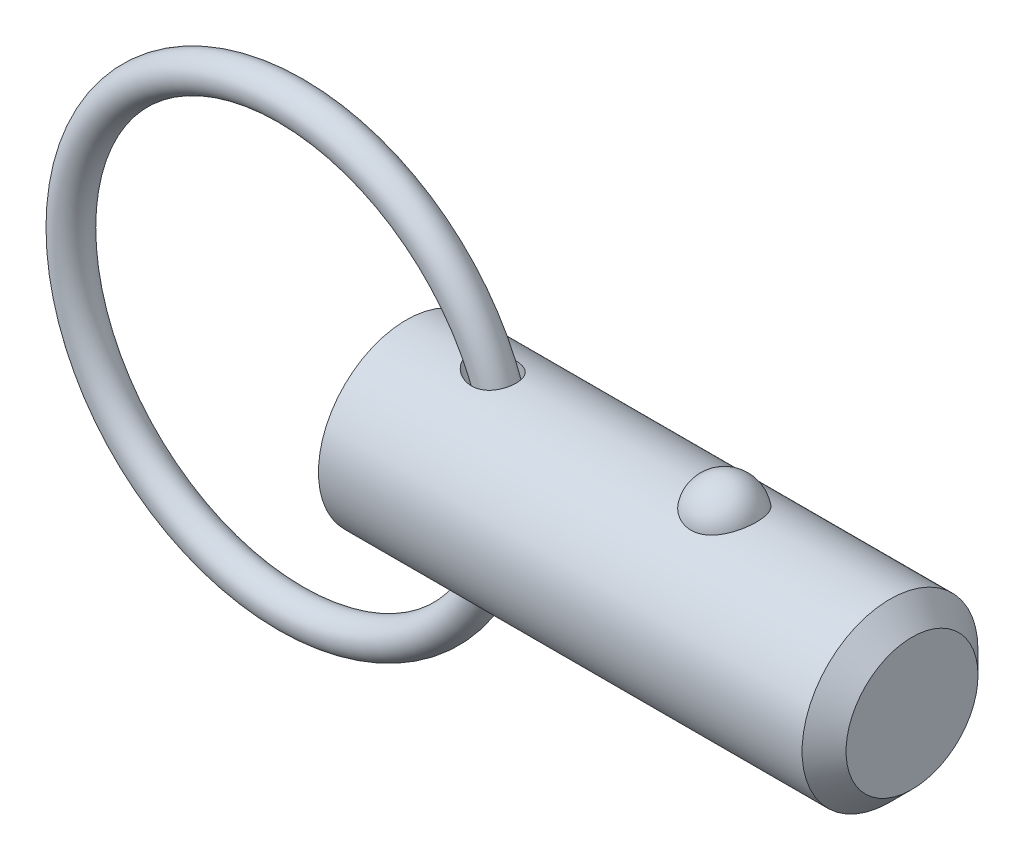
ISO-10303-21;
HEADER;
FILE_DESCRIPTION(('STEP AP214'),'2;1');
FILE_NAME('part.step','',(''),(''),'','','');
FILE_SCHEMA(('AUTOMOTIVE_DESIGN { 1 0 10303 214 1 1 1 1 }'));
ENDSEC;
DATA;
#1=APPLICATION_CONTEXT('core data for automotive mechanical design processes');
#2=APPLICATION_PROTOCOL_DEFINITION('international standard','automotive_design',2000,#1);
#3=PRODUCT_CONTEXT('',#1,'mechanical');
#4=PRODUCT('Part','Part','',(#3));
#5=PRODUCT_RELATED_PRODUCT_CATEGORY('part','',(#4));
#6=PRODUCT_DEFINITION_FORMATION('','',#4);
#7=PRODUCT_DEFINITION_CONTEXT('part definition',#1,'design');
#8=PRODUCT_DEFINITION('design','',#6,#7);
#9=PRODUCT_DEFINITION_SHAPE('','',#8);
#10=(LENGTH_UNIT() NAMED_UNIT(*) SI_UNIT(.MILLI.,.METRE.));
#11=(NAMED_UNIT(*) PLANE_ANGLE_UNIT() SI_UNIT($,.RADIAN.));
#12=(NAMED_UNIT(*) SI_UNIT($,.STERADIAN.) SOLID_ANGLE_UNIT());
#13=UNCERTAINTY_MEASURE_WITH_UNIT(LENGTH_MEASURE(1.E-05),#10,'distance_accuracy_value','');
#14=(GEOMETRIC_REPRESENTATION_CONTEXT(3) GLOBAL_UNCERTAINTY_ASSIGNED_CONTEXT((#13)) GLOBAL_UNIT_ASSIGNED_CONTEXT((#10,
#11,#12)) REPRESENTATION_CONTEXT('',''));
#15=CARTESIAN_POINT('',(0.,0.,0.));
#16=DIRECTION('',(0.,0.,1.));
#17=DIRECTION('',(1.,0.,0.));
#18=AXIS2_PLACEMENT_3D('',#15,#16,#17);
#19=CARTESIAN_POINT('',(-8.34703434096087,0.,0.));
#20=DIRECTION('',(0.,0.,1.));
#21=DIRECTION('',(1.,0.,0.));
#22=AXIS2_PLACEMENT_3D('',#19,#20,#21);
#23=TOROIDAL_SURFACE('',#22,15.875,1.27);
#24=CARTESIAN_POINT('',(8.79796565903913,0.,0.));
#25=VERTEX_POINT('',#24);
#26=VERTEX_LOOP('',#25);
#27=FACE_BOUND('',#26,.T.);
#28=ADVANCED_FACE('P0_F12',(#27),#23,.T.);
#29=CLOSED_SHELL('',(#28));
#30=MANIFOLD_SOLID_BREP('P0_B1',#29);
#31=CARTESIAN_POINT('',(0.,0.,0.));
#32=DIRECTION('',(1.,0.,0.));
#33=DIRECTION('',(0.,0.,-1.));
#34=AXIS2_PLACEMENT_3D('',#31,#32,#33);
#35=CYLINDRICAL_SURFACE('',#34,6.35);
#36=CARTESIAN_POINT('',(4.87230670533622,6.27273159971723,-0.987592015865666));
#37=CARTESIAN_POINT('',(4.94734735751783,6.26035058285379,-1.06623378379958));
#38=CARTESIAN_POINT('',(5.02968768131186,6.24755813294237,-1.13788608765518));
#39=CARTESIAN_POINT('',(5.2053426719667,6.22278258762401,-1.26640223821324));
#40=CARTESIAN_POINT('',(5.29867273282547,6.21080066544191,-1.32324497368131));
#41=CARTESIAN_POINT('',(5.49318962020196,6.18912414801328,-1.42117930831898));
#42=CARTESIAN_POINT('',(5.59435470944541,6.17942350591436,-1.46231273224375));
#43=CARTESIAN_POINT('',(5.80219659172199,6.16352555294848,-1.52793951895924));
#44=CARTESIAN_POINT('',(5.90887152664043,6.15732706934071,-1.55243845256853));
#45=CARTESIAN_POINT('',(6.12818220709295,6.14931784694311,-1.58387975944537));
#46=CARTESIAN_POINT('',(6.24090110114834,6.14763959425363,-1.59029227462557));
#47=CARTESIAN_POINT('',(6.46560233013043,6.14965588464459,-1.58248630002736));
#48=CARTESIAN_POINT('',(6.57758514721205,6.15334646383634,-1.56828303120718));
#49=CARTESIAN_POINT('',(6.78516594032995,6.1652116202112,-1.52091398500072));
#50=CARTESIAN_POINT('',(6.88126802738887,6.17288876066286,-1.48983713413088));
#51=CARTESIAN_POINT('',(7.06576629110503,6.19149190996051,-1.41052329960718));
#52=CARTESIAN_POINT('',(7.15416739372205,6.20241582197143,-1.36229738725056));
#53=CARTESIAN_POINT('',(7.31166929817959,6.2248616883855,-1.25548983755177));
#54=CARTESIAN_POINT('',(7.3818144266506,6.23621734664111,-1.19840625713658));
#55=CARTESIAN_POINT('',(7.51101296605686,6.259037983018,-1.07284763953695));
#56=CARTESIAN_POINT('',(7.57006844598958,6.2705029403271,-1.00437473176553));
#57=CARTESIAN_POINT('',(7.6737469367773,6.29184873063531,-0.860384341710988));
#58=CARTESIAN_POINT('',(7.71876694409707,6.30176816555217,-0.785157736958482));
#59=CARTESIAN_POINT('',(7.79574491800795,6.31935829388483,-0.628053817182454));
#60=CARTESIAN_POINT('',(7.82770308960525,6.32702902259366,-0.546176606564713));
#61=CARTESIAN_POINT('',(7.87788845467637,6.33930929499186,-0.377876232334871));
#62=CARTESIAN_POINT('',(7.89608106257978,6.34391112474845,-0.291442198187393));
#63=CARTESIAN_POINT('',(7.9182072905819,6.34953044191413,-0.116652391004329));
#64=CARTESIAN_POINT('',(7.92214044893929,6.35054781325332,-0.0282965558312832));
#65=CARTESIAN_POINT('',(7.91564686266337,6.34888556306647,0.148263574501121));
#66=CARTESIAN_POINT('',(7.90515337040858,6.34618875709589,0.236465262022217));
#67=CARTESIAN_POINT('',(7.8699153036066,6.33735741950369,0.409798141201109));
#68=CARTESIAN_POINT('',(7.84517062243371,6.33122286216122,0.494929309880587));
#69=CARTESIAN_POINT('',(7.7819985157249,6.31618517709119,0.659657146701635));
#70=CARTESIAN_POINT('',(7.74357645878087,6.30728313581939,0.739255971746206));
#71=CARTESIAN_POINT('',(7.65396632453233,6.28769050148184,0.890663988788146));
#72=CARTESIAN_POINT('',(7.60277911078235,6.27700002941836,0.962473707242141));
#73=CARTESIAN_POINT('',(7.48925881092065,6.2550822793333,1.09590260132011));
#74=CARTESIAN_POINT('',(7.42698604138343,6.24385813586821,1.15757361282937));
#75=CARTESIAN_POINT('',(7.29283556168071,6.2220655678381,1.26951234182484));
#76=CARTESIAN_POINT('',(7.22095880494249,6.21149707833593,1.31978118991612));
#77=CARTESIAN_POINT('',(7.06971853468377,6.19216002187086,1.40772509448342));
#78=CARTESIAN_POINT('',(6.99035873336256,6.18339056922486,1.44540635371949));
#79=CARTESIAN_POINT('',(6.82642723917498,6.16851603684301,1.50762653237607));
#80=CARTESIAN_POINT('',(6.7418548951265,6.16241129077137,1.53216380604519));
#81=CARTESIAN_POINT('',(6.56686412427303,6.15321474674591,1.56869994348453));
#82=CARTESIAN_POINT('',(6.47634467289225,6.15023369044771,1.58023897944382));
#83=CARTESIAN_POINT('',(6.29456956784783,6.14778331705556,1.58974172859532));
#84=CARTESIAN_POINT('',(6.20331368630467,6.1483151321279,1.58770106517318));
#85=CARTESIAN_POINT('',(6.01385969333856,6.15284811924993,1.5700487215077));
#86=CARTESIAN_POINT('',(5.91578322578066,6.15715979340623,1.55322212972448));
#87=CARTESIAN_POINT('',(5.72331909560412,6.16902415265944,1.5054032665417));
#88=CARTESIAN_POINT('',(5.6289344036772,6.17657939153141,1.4743998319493));
#89=CARTESIAN_POINT('',(5.4357260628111,6.19502494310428,1.39499475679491));
#90=CARTESIAN_POINT('',(5.33755891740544,6.20619097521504,1.34505268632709));
#91=CARTESIAN_POINT('',(5.15090047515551,6.23006191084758,1.22975103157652));
#92=CARTESIAN_POINT('',(5.06240741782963,6.24276653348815,1.16439425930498));
#93=CARTESIAN_POINT('',(4.91171642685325,6.26607433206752,1.03083814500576));
#94=CARTESIAN_POINT('',(4.84758224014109,6.27668356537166,0.964825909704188));
#95=CARTESIAN_POINT('',(4.73090054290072,6.29683133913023,0.823112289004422));
#96=CARTESIAN_POINT('',(4.67833688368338,6.30637136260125,0.747424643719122));
#97=CARTESIAN_POINT('',(4.59543145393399,6.32183254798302,0.601150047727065));
#98=CARTESIAN_POINT('',(4.56283099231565,6.32809321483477,0.531883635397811));
#99=CARTESIAN_POINT('',(4.50941370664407,6.33849198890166,0.388778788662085));
#100=CARTESIAN_POINT('',(4.48858876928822,6.34263155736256,0.314943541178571));
#101=CARTESIAN_POINT('',(4.46008864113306,6.3483236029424,0.164282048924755));
#102=CARTESIAN_POINT('',(4.45247558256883,6.34986385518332,0.08744340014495));
#103=CARTESIAN_POINT('',(4.45121096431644,6.35011863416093,-0.0663538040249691));
#104=CARTESIAN_POINT('',(4.45755802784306,6.34883343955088,-0.143312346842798));
#105=CARTESIAN_POINT('',(4.48267656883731,6.34380948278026,-0.288945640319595));
#106=CARTESIAN_POINT('',(4.50045680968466,6.34026665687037,-0.357802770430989));
#107=CARTESIAN_POINT('',(4.54636050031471,6.33128211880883,-0.491815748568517));
#108=CARTESIAN_POINT('',(4.57448566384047,6.32584009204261,-0.556970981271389));
#109=CARTESIAN_POINT('',(4.64209700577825,6.31308107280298,-0.687092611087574));
#110=CARTESIAN_POINT('',(4.68226903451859,6.30565525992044,-0.751689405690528));
#111=CARTESIAN_POINT('',(4.77120834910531,6.28979741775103,-0.874524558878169));
#112=CARTESIAN_POINT('',(4.81998302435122,6.28136452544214,-0.932757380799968));
#113=CARTESIAN_POINT('',(4.87230670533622,6.27273159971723,-0.987592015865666));
#114=B_SPLINE_CURVE_WITH_KNOTS('',3,(#36,#37,#38,#39,#40,#41,#42,#43,#44,#45,#46,#47,#48,#49,
#50,#51,#52,#53,#54,#55,#56,#57,#58,#59,#60,#61,#62,#63,#64,#65,#66,#67,#68,#69,#70,#71,#72,#73,
#74,#75,#76,#77,#78,#79,#80,#81,#82,#83,#84,#85,#86,#87,#88,#89,#90,#91,#92,#93,#94,#95,#96,#97,
#98,#99,#100,#101,#102,#103,#104,#105,#106,#107,#108,#109,#110,#111,#112,#113),.UNSPECIFIED.,
.T.,.F.,(4,2,2,2,2,2,2,2,2,2,2,2,2,2,2,2,2,2,2,2,2,2,2,2,2,2,2,2,2,2,2,2,2,2,2,2,2,2,4),(0.,
0.327902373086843,0.65626964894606,0.983756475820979,1.31113357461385,1.64800657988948,
1.98463099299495,2.28681225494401,2.58879878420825,2.86088594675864,3.13292229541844,
3.3963648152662,3.65980320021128,3.92390128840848,4.18800792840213,4.45334062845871,
4.7186753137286,4.98390596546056,5.24911867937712,5.51293017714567,5.7767155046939,
6.04037065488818,6.30405880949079,6.57680801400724,6.84964512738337,7.14724526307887,
7.44508014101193,7.77572668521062,8.10631295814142,8.38318772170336,8.65967357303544,
8.88915303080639,9.11847418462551,9.34887088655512,9.57924486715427,9.79193291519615,
10.0046562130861,10.2330958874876,10.4617327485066),.UNSPECIFIED.);
#115=CARTESIAN_POINT('',(4.87230670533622,6.27273159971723,-0.987592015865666));
#116=VERTEX_POINT('',#115);
#117=EDGE_CURVE('P1_E40',#116,#116,#114,.T.);
#118=ORIENTED_EDGE('',*,*,#117,.T.);
#119=EDGE_LOOP('',(#118));
#120=FACE_BOUND('',#119,.T.);
#121=CARTESIAN_POINT('',(34.9125,0.,0.));
#122=DIRECTION('',(1.,0.,0.));
#123=DIRECTION('',(0.,0.,-1.));
#124=AXIS2_PLACEMENT_3D('',#121,#122,#123);
#125=CIRCLE('',#124,6.35);
#126=CARTESIAN_POINT('',(34.9125,0.,-6.35));
#127=VERTEX_POINT('',#126);
#128=EDGE_CURVE('P1_E25',#127,#127,#125,.T.);
#129=ORIENTED_EDGE('',*,*,#128,.F.);
#130=EDGE_LOOP('',(#129));
#131=FACE_BOUND('',#130,.T.);
#132=CARTESIAN_POINT('',(0.,0.,0.));
#133=DIRECTION('',(1.,0.,0.));
#134=DIRECTION('',(0.,0.,-1.));
#135=AXIS2_PLACEMENT_3D('',#132,#133,#134);
#136=CIRCLE('',#135,6.35);
#137=CARTESIAN_POINT('',(0.,0.,-6.35));
#138=VERTEX_POINT('',#137);
#139=EDGE_CURVE('P1_E9',#138,#138,#136,.T.);
#140=ORIENTED_EDGE('',*,*,#139,.T.);
#141=EDGE_LOOP('',(#140));
#142=FACE_BOUND('',#141,.T.);
#143=CARTESIAN_POINT('',(22.9500214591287,5.87502187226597,2.40969251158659));
#144=CARTESIAN_POINT('',(22.8250305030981,5.87501645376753,2.40969773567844));
#145=CARTESIAN_POINT('',(22.7000806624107,5.87916061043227,2.39967292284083));
#146=CARTESIAN_POINT('',(22.4539091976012,5.8952311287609,2.35991730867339));
#147=CARTESIAN_POINT('',(22.3326863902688,5.90715499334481,2.33019283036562));
#148=CARTESIAN_POINT('',(22.0975170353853,5.93739567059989,2.25201402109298));
#149=CARTESIAN_POINT('',(21.9835602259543,5.95570321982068,2.20358681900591));
#150=CARTESIAN_POINT('',(21.76557352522,5.99672067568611,2.08937987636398));
#151=CARTESIAN_POINT('',(21.6615457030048,6.01943149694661,2.02359652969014));
#152=CARTESIAN_POINT('',(21.4629437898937,6.06760647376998,1.87428969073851));
#153=CARTESIAN_POINT('',(21.3687268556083,6.09313095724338,1.79031110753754));
#154=CARTESIAN_POINT('',(21.1952557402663,6.14375873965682,1.60800178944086));
#155=CARTESIAN_POINT('',(21.1160043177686,6.16886196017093,1.50966841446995));
#156=CARTESIAN_POINT('',(20.9708457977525,6.21724600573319,1.29645884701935));
#157=CARTESIAN_POINT('',(20.9056885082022,6.24039621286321,1.18104158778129));
#158=CARTESIAN_POINT('',(20.7947035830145,6.28117277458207,0.94035184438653));
#159=CARTESIAN_POINT('',(20.7488776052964,6.29879865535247,0.815078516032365));
#160=CARTESIAN_POINT('',(20.6770234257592,6.32692073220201,0.556494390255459));
#161=CARTESIAN_POINT('',(20.651249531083,6.33732517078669,0.423102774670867));
#162=CARTESIAN_POINT('',(20.6209885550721,6.34957673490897,0.15354272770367));
#163=CARTESIAN_POINT('',(20.6165009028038,6.35142408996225,0.0173743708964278));
#164=CARTESIAN_POINT('',(20.6288655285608,6.34638925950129,-0.253036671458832));
#165=CARTESIAN_POINT('',(20.6455949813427,6.33955731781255,-0.387285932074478));
#166=CARTESIAN_POINT('',(20.699843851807,6.31794129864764,-0.650851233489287));
#167=CARTESIAN_POINT('',(20.7373636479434,6.30315707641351,-0.780167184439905));
#168=CARTESIAN_POINT('',(20.832500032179,6.26711642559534,-1.03041949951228));
#169=CARTESIAN_POINT('',(20.890143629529,6.24585130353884,-1.15134433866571));
#170=CARTESIAN_POINT('',(21.0243522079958,6.19905619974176,-1.38129800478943));
#171=CARTESIAN_POINT('',(21.1009187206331,6.17352587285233,-1.49032586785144));
#172=CARTESIAN_POINT('',(21.2717538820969,6.12080227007,-1.69393164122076));
#173=CARTESIAN_POINT('',(21.3661008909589,6.09360200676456,-1.78844209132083));
#174=CARTESIAN_POINT('',(21.5701196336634,6.04070434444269,-1.95970536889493));
#175=CARTESIAN_POINT('',(21.6797900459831,6.01500681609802,-2.03645972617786));
#176=CARTESIAN_POINT('',(21.9091876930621,5.96867714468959,-2.1684564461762));
#177=CARTESIAN_POINT('',(22.0286522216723,5.94794910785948,-2.2241206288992));
#178=CARTESIAN_POINT('',(22.2762188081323,5.91340580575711,-2.31440992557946));
#179=CARTESIAN_POINT('',(22.4043175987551,5.8995879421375,-2.3490429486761));
#180=CARTESIAN_POINT('',(22.658582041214,5.88111049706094,-2.39491590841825));
#181=CARTESIAN_POINT('',(22.7845207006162,5.876025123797,-2.40724512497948));
#182=CARTESIAN_POINT('',(23.0367867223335,5.87428980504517,-2.41147867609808));
#183=CARTESIAN_POINT('',(23.163114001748,5.87763817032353,-2.40338710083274));
#184=CARTESIAN_POINT('',(23.4084170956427,5.89212921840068,-2.36762715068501));
#185=CARTESIAN_POINT('',(23.5274992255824,5.90302431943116,-2.34058030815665));
#186=CARTESIAN_POINT('',(23.7592447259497,5.93113752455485,-2.26839066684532));
#187=CARTESIAN_POINT('',(23.8719075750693,5.94835614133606,-2.22324640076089));
#188=CARTESIAN_POINT('',(24.0904009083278,5.98773016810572,-2.11493806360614));
#189=CARTESIAN_POINT('',(24.196028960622,6.00998499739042,-2.05140269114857));
#190=CARTESIAN_POINT('',(24.3953006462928,6.05690144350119,-1.90842705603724));
#191=CARTESIAN_POINT('',(24.4889415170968,6.08156361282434,-1.8289831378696));
#192=CARTESIAN_POINT('',(24.6666754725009,6.13211715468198,-1.65182429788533));
#193=CARTESIAN_POINT('',(24.750055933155,6.15800825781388,-1.55339381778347));
#194=CARTESIAN_POINT('',(24.8997900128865,6.20712834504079,-1.34374214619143));
#195=CARTESIAN_POINT('',(24.9661405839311,6.23035685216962,-1.23251867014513));
#196=CARTESIAN_POINT('',(25.0823455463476,6.27251177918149,-0.996447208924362));
#197=CARTESIAN_POINT('',(25.1316072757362,6.29127762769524,-0.871278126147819));
#198=CARTESIAN_POINT('',(25.2096142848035,6.3215862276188,-0.61387013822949));
#199=CARTESIAN_POINT('',(25.238359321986,6.33312889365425,-0.481631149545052));
#200=CARTESIAN_POINT('',(25.2747705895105,6.34782349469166,-0.213672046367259));
#201=CARTESIAN_POINT('',(25.2824134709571,6.35096613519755,-0.0779482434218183));
#202=CARTESIAN_POINT('',(25.2763951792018,6.34851322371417,0.192943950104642));
#203=CARTESIAN_POINT('',(25.2627343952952,6.3429178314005,0.328112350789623));
#204=CARTESIAN_POINT('',(25.2145036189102,6.32360512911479,0.593406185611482));
#205=CARTESIAN_POINT('',(25.1800313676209,6.30992579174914,0.723552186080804));
#206=CARTESIAN_POINT('',(25.0909539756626,6.27586325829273,0.97583417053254));
#207=CARTESIAN_POINT('',(25.0363476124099,6.25547965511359,1.09796966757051));
#208=CARTESIAN_POINT('',(24.9077587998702,6.20998183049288,1.33148921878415));
#209=CARTESIAN_POINT('',(24.8336742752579,6.18484288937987,1.44281227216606));
#210=CARTESIAN_POINT('',(24.6678204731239,6.13258735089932,1.65087683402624));
#211=CARTESIAN_POINT('',(24.5760515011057,6.10547078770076,1.74761859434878));
#212=CARTESIAN_POINT('',(24.3771839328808,6.0523587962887,1.92350926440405));
#213=CARTESIAN_POINT('',(24.270133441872,6.0263601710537,2.00271146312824));
#214=CARTESIAN_POINT('',(24.0431384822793,5.97843747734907,2.14154159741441));
#215=CARTESIAN_POINT('',(23.923191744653,5.95651412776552,2.20116608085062));
#216=CARTESIAN_POINT('',(23.6645236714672,5.91812106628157,2.30250570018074));
#217=CARTESIAN_POINT('',(23.5250698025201,5.90217533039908,2.34256795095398));
#218=CARTESIAN_POINT('',(23.2403974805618,5.88063128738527,2.39615214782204));
#219=CARTESIAN_POINT('',(23.0951817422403,5.8750281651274,2.40968644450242));
#220=CARTESIAN_POINT('',(22.9500214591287,5.87502187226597,2.40969251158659));
#221=B_SPLINE_CURVE_WITH_KNOTS('',3,(#143,#144,#145,#146,#147,#148,#149,#150,#151,#152,#153,
#154,#155,#156,#157,#158,#159,#160,#161,#162,#163,#164,#165,#166,#167,#168,#169,#170,#171,#172,
#173,#174,#175,#176,#177,#178,#179,#180,#181,#182,#183,#184,#185,#186,#187,#188,#189,#190,#191,
#192,#193,#194,#195,#196,#197,#198,#199,#200,#201,#202,#203,#204,#205,#206,#207,#208,#209,#210,
#211,#212,#213,#214,#215,#216,#217,#218,#219,#220),.UNSPECIFIED.,.T.,.F.,(4,2,2,2,2,2,2,2,2,2,2,
2,2,2,2,2,2,2,2,2,2,2,2,2,2,2,2,2,2,2,2,2,2,2,2,2,2,2,4),(0.,0.374440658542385,
0.748761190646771,1.12254078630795,1.49639810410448,1.88098871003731,2.26565013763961,
2.6674110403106,3.06920639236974,3.47601794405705,3.88281858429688,4.28727498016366,
4.69173873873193,5.09674745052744,5.5017889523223,5.90865911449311,6.31549420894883,
6.71369855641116,7.11175305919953,7.48978077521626,7.86773278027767,8.23383886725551,
8.59997464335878,8.97409044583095,9.34829231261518,9.74122667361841,10.1342313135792,
10.5397522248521,10.9452779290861,11.3512521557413,11.7572189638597,12.1612938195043,
12.5653932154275,12.9716540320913,13.3779078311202,13.7829098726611,14.1879832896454,
14.6230486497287,15.0579114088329),.UNSPECIFIED.);
#222=CARTESIAN_POINT('',(22.9500214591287,5.87502187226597,2.40969251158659));
#223=VERTEX_POINT('',#222);
#224=EDGE_CURVE('P1_E34',#223,#223,#221,.T.);
#225=ORIENTED_EDGE('',*,*,#224,.T.);
#226=EDGE_LOOP('',(#225));
#227=FACE_BOUND('',#226,.T.);
#228=CARTESIAN_POINT('',(4.87230670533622,-6.27273159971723,-0.987592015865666));
#229=CARTESIAN_POINT('',(4.81440819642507,-6.28228431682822,-0.926913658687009));
#230=CARTESIAN_POINT('',(4.76085022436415,-6.29159289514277,-0.862071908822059));
#231=CARTESIAN_POINT('',(4.66448472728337,-6.3088950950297,-0.72465504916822));
#232=CARTESIAN_POINT('',(4.62166818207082,-6.31688981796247,-0.652086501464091));
#233=CARTESIAN_POINT('',(4.54882773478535,-6.33076917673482,-0.49974775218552));
#234=CARTESIAN_POINT('',(4.51891553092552,-6.33663532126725,-0.419921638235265));
#235=CARTESIAN_POINT('',(4.47476924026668,-6.3453711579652,-0.255882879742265));
#236=CARTESIAN_POINT('',(4.46051880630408,-6.34824397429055,-0.171674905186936));
#237=CARTESIAN_POINT('',(4.44966179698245,-6.35043041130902,-0.0120763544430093));
#238=CARTESIAN_POINT('',(4.45117530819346,-6.35012328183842,0.0631849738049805));
#239=CARTESIAN_POINT('',(4.46726452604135,-6.34689000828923,0.212230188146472));
#240=CARTESIAN_POINT('',(4.48184026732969,-6.3439638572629,0.286014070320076));
#241=CARTESIAN_POINT('',(4.52202068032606,-6.33603071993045,0.426550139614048));
#242=CARTESIAN_POINT('',(4.54707079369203,-6.33112875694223,0.493469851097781));
#243=CARTESIAN_POINT('',(4.6066985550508,-6.31972370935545,0.622743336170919));
#244=CARTESIAN_POINT('',(4.64127887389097,-6.31322017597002,0.685095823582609));
#245=CARTESIAN_POINT('',(4.72328142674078,-6.29826068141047,0.811769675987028));
#246=CARTESIAN_POINT('',(4.77176118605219,-6.28966287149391,0.875386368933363));
#247=CARTESIAN_POINT('',(4.87703902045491,-6.27182325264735,0.99519278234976));
#248=CARTESIAN_POINT('',(4.93384225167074,-6.26258104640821,1.05137785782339));
#249=CARTESIAN_POINT('',(5.0661743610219,-6.24228878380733,1.16635591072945));
#250=CARTESIAN_POINT('',(5.1431816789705,-6.23124423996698,1.22345054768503));
#251=CARTESIAN_POINT('',(5.30475767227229,-6.21023402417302,1.32598441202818));
#252=CARTESIAN_POINT('',(5.3893323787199,-6.20026922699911,1.37141422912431));
#253=CARTESIAN_POINT('',(5.5776013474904,-6.18099350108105,1.45601817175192));
#254=CARTESIAN_POINT('',(5.68224348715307,-6.17201456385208,1.4931788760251));
#255=CARTESIAN_POINT('',(5.89649087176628,-6.15800474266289,1.5499484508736));
#256=CARTESIAN_POINT('',(6.00609708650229,-6.15297463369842,1.56955387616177));
#257=CARTESIAN_POINT('',(6.22752772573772,-6.14779725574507,1.58971993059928));
#258=CARTESIAN_POINT('',(6.33935715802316,-6.14766266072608,1.59023112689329));
#259=CARTESIAN_POINT('',(6.56108231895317,-6.15269227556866,1.57066564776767));
#260=CARTESIAN_POINT('',(6.67097982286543,-6.15785133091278,1.55060899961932));
#261=CARTESIAN_POINT('',(6.87257705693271,-6.17211580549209,1.4927326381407));
#262=CARTESIAN_POINT('',(6.96494608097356,-6.18072242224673,1.45711948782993));
#263=CARTESIAN_POINT('',(7.14129343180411,-6.20069920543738,1.36960980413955));
#264=CARTESIAN_POINT('',(7.22527609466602,-6.21206793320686,1.31772174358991));
#265=CARTESIAN_POINT('',(7.37471505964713,-6.23497047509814,1.20443359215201));
#266=CARTESIAN_POINT('',(7.44115811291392,-6.24639757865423,1.14430788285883));
#267=CARTESIAN_POINT('',(7.5626186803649,-6.26896339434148,1.0134084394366));
#268=CARTESIAN_POINT('',(7.61763801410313,-6.28010215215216,0.942636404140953));
#269=CARTESIAN_POINT('',(7.71360563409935,-6.30055923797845,0.794304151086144));
#270=CARTESIAN_POINT('',(7.75485562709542,-6.3099143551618,0.716943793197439));
#271=CARTESIAN_POINT('',(7.82406051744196,-6.32610528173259,0.556244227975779));
#272=CARTESIAN_POINT('',(7.8520154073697,-6.33294108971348,0.472905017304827));
#273=CARTESIAN_POINT('',(7.89408663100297,-6.34338077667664,0.302249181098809));
#274=CARTESIAN_POINT('',(7.90814615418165,-6.34697138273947,0.214917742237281));
#275=CARTESIAN_POINT('',(7.92192329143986,-6.35048887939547,0.0390564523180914));
#276=CARTESIAN_POINT('',(7.92164046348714,-6.3504156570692,-0.0494734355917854));
#277=CARTESIAN_POINT('',(7.90670754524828,-6.34660520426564,-0.225592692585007));
#278=CARTESIAN_POINT('',(7.89199989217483,-6.34285329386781,-0.31317687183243));
#279=CARTESIAN_POINT('',(7.8484534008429,-6.33206809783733,-0.484549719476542));
#280=CARTESIAN_POINT('',(7.81961455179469,-6.32503480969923,-0.568338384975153));
#281=CARTESIAN_POINT('',(7.74850591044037,-6.30846389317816,-0.729625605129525));
#282=CARTESIAN_POINT('',(7.70625193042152,-6.29892921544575,-0.807131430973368));
#283=CARTESIAN_POINT('',(7.60933437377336,-6.27840608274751,-0.953731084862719));
#284=CARTESIAN_POINT('',(7.55467181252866,-6.2674177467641,-1.02282560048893));
#285=CARTESIAN_POINT('',(7.43471786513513,-6.24527869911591,-1.15028913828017));
#286=CARTESIAN_POINT('',(7.36948829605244,-6.23412925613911,-1.20871657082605));
#287=CARTESIAN_POINT('',(7.23001723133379,-6.21283678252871,-1.3137894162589));
#288=CARTESIAN_POINT('',(7.15577649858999,-6.20269366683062,-1.36043582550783));
#289=CARTESIAN_POINT('',(7.00025986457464,-6.18446636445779,-1.4410399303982));
#290=CARTESIAN_POINT('',(6.91896776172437,-6.17638709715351,-1.47496739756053));
#291=CARTESIAN_POINT('',(6.75184232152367,-6.16309237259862,-1.52957024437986));
#292=CARTESIAN_POINT('',(6.66600814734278,-6.15787744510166,-1.55024317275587));
#293=CARTESIAN_POINT('',(6.48842585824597,-6.15055064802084,-1.57906962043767));
#294=CARTESIAN_POINT('',(6.39658108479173,-6.14857915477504,-1.58665744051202));
#295=CARTESIAN_POINT('',(6.2127983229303,-6.14817707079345,-1.58821048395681));
#296=CARTESIAN_POINT('',(6.12086031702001,-6.14974736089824,-1.58217231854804));
#297=CARTESIAN_POINT('',(5.92996902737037,-6.15640095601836,-1.55609403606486));
#298=CARTESIAN_POINT('',(5.83120653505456,-6.16181208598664,-1.53474519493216));
#299=CARTESIAN_POINT('',(5.63804881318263,-6.17573474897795,-1.47771859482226));
#300=CARTESIAN_POINT('',(5.54365953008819,-6.18425037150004,-1.44202192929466));
#301=CARTESIAN_POINT('',(5.34413923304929,-6.20522938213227,-1.34918979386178));
#302=CARTESIAN_POINT('',(5.24033140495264,-6.21813417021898,-1.28928337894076));
#303=CARTESIAN_POINT('',(5.04554233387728,-6.24510162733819,-1.15156760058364));
#304=CARTESIAN_POINT('',(4.9545459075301,-6.25916289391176,-1.07377972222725));
#305=CARTESIAN_POINT('',(4.87230670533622,-6.27273159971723,-0.987592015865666));
#306=B_SPLINE_CURVE_WITH_KNOTS('',3,(#228,#229,#230,#231,#232,#233,#234,#235,#236,#237,#238,
#239,#240,#241,#242,#243,#244,#245,#246,#247,#248,#249,#250,#251,#252,#253,#254,#255,#256,#257,
#258,#259,#260,#261,#262,#263,#264,#265,#266,#267,#268,#269,#270,#271,#272,#273,#274,#275,#276,
#277,#278,#279,#280,#281,#282,#283,#284,#285,#286,#287,#288,#289,#290,#291,#292,#293,#294,#295,
#296,#297,#298,#299,#300,#301,#302,#303,#304,#305),.UNSPECIFIED.,.T.,.F.,(4,2,2,2,2,2,2,2,2,2,2,
2,2,2,2,2,2,2,2,2,2,2,2,2,2,2,2,2,2,2,2,2,2,2,2,2,2,2,4),(0.,0.252951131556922,
0.505689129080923,0.760572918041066,1.01519041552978,1.23982791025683,1.46446600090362,
1.67847364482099,1.89254132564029,2.13299551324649,2.37359928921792,2.6619896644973,
2.95061196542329,3.28329078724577,3.61603488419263,3.9496403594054,4.28292130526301,
4.57939201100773,4.87570862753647,5.14538810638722,5.41502459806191,5.67829123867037,
5.94155802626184,6.20589676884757,6.47024365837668,6.73564974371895,7.00105603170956,
7.26615064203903,7.53122356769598,7.79479837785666,8.05835088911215,8.32252586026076,
8.58674967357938,8.86213419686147,9.137587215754,9.43991696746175,9.74264642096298,
10.1023688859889,10.461661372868),.UNSPECIFIED.);
#307=CARTESIAN_POINT('',(4.87230670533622,-6.27273159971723,-0.987592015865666));
#308=VERTEX_POINT('',#307);
#309=EDGE_CURVE('P1_E17',#308,#308,#306,.T.);
#310=ORIENTED_EDGE('',*,*,#309,.T.);
#311=EDGE_LOOP('',(#310));
#312=FACE_BOUND('',#311,.T.);
#313=ADVANCED_FACE('P1_F13',(#120,#131,#142,#227,#312),#35,.T.);
#314=CARTESIAN_POINT('',(0.,0.,0.));
#315=DIRECTION('',(-1.,0.,0.));
#316=DIRECTION('',(0.,0.,1.));
#317=AXIS2_PLACEMENT_3D('',#314,#315,#316);
#318=PLANE('',#317);
#319=ORIENTED_EDGE('',*,*,#139,.F.);
#320=EDGE_LOOP('',(#319));
#321=FACE_BOUND('',#320,.T.);
#322=ADVANCED_FACE('P1_F15',(#321),#318,.T.);
#323=CARTESIAN_POINT('',(36.5,0.,0.));
#324=DIRECTION('',(-1.,0.,0.));
#325=DIRECTION('',(0.,0.,1.));
#326=AXIS2_PLACEMENT_3D('',#323,#324,#325);
#327=CONICAL_SURFACE('',#326,4.7625,0.78539816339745);
#328=ORIENTED_EDGE('',*,*,#128,.T.);
#329=EDGE_LOOP('',(#328));
#330=FACE_BOUND('',#329,.T.);
#331=CARTESIAN_POINT('',(36.5,0.,0.));
#332=DIRECTION('',(1.,0.,0.));
#333=DIRECTION('',(0.,0.,-1.));
#334=AXIS2_PLACEMENT_3D('',#331,#332,#333);
#335=CIRCLE('',#334,4.7625);
#336=CARTESIAN_POINT('',(36.5,0.,-4.7625));
#337=VERTEX_POINT('',#336);
#338=EDGE_CURVE('P1_E30',#337,#337,#335,.T.);
#339=ORIENTED_EDGE('',*,*,#338,.F.);
#340=EDGE_LOOP('',(#339));
#341=FACE_BOUND('',#340,.T.);
#342=ADVANCED_FACE('P1_F55',(#330,#341),#327,.T.);
#343=CARTESIAN_POINT('',(36.5,4.7625,0.));
#344=DIRECTION('',(1.,0.,0.));
#345=DIRECTION('',(0.,0.,-1.));
#346=AXIS2_PLACEMENT_3D('',#343,#344,#345);
#347=PLANE('',#346);
#348=ORIENTED_EDGE('',*,*,#338,.T.);
#349=EDGE_LOOP('',(#348));
#350=FACE_BOUND('',#349,.T.);
#351=ADVANCED_FACE('P1_F51',(#350),#347,.T.);
#352=CARTESIAN_POINT('',(22.9500214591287,5.715,0.));
#353=DIRECTION('',(-1.,0.,0.));
#354=DIRECTION('',(0.,1.,0.));
#355=AXIS2_PLACEMENT_3D('',#352,#353,#354);
#356=SPHERICAL_SURFACE('',#355,2.415);
#357=ORIENTED_EDGE('',*,*,#224,.F.);
#358=EDGE_LOOP('',(#357));
#359=FACE_BOUND('',#358,.T.);
#360=ADVANCED_FACE('P1_F46',(#359),#356,.T.);
#361=CARTESIAN_POINT('',(-8.34703434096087,0.,0.));
#362=DIRECTION('',(0.,0.,1.));
#363=DIRECTION('',(1.,0.,0.));
#364=AXIS2_PLACEMENT_3D('',#361,#362,#363);
#365=TOROIDAL_SURFACE('',#364,15.875,1.5875);
#366=ORIENTED_EDGE('',*,*,#309,.F.);
#367=EDGE_LOOP('',(#366));
#368=FACE_BOUND('',#367,.T.);
#369=ORIENTED_EDGE('',*,*,#117,.F.);
#370=EDGE_LOOP('',(#369));
#371=FACE_BOUND('',#370,.T.);
#372=ADVANCED_FACE('P1_F50',(#368,#371),#365,.F.);
#373=CLOSED_SHELL('',(#313,#322,#342,#351,#360,#372));
#374=MANIFOLD_SOLID_BREP('P1_B1',#373);
#375=ADVANCED_BREP_SHAPE_REPRESENTATION('',(#18,#30,#374),#14);
#376=SHAPE_DEFINITION_REPRESENTATION(#9,#375);
ENDSEC;
END-ISO-10303-21;
